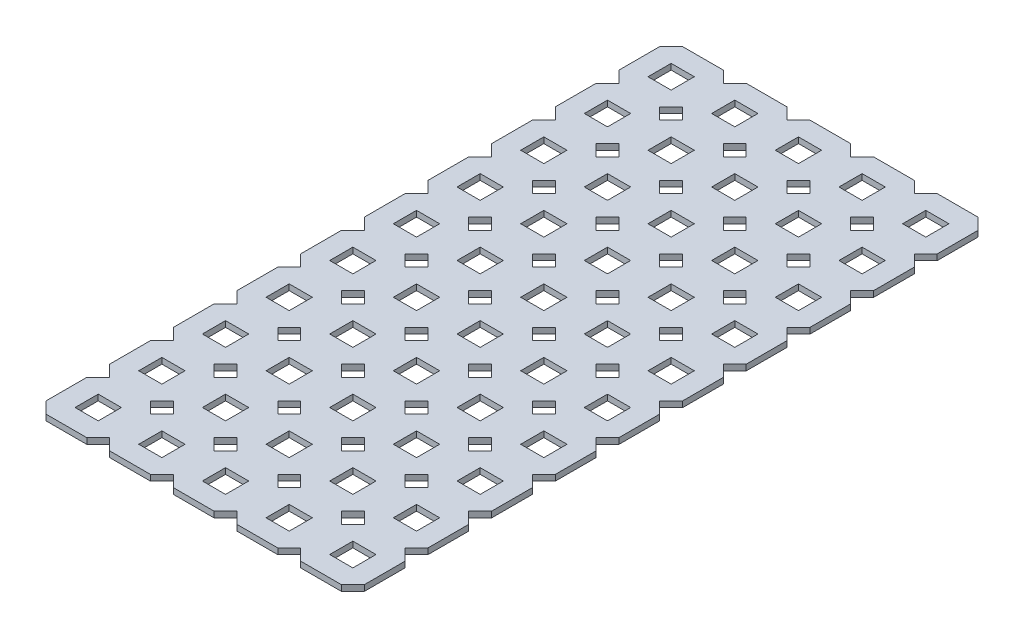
from build123d import *

# Parameters (mm, degrees)
SKETCH1_W           = 4.6228
SKETCH1_H           = 4.6228
BOSS_EXTRUDE1_DEPTH = 1.1684


with BuildPart() as part:
    # Sketch1 → Boss-Extrude1 (new body)
    with BuildSketch(Plane(origin=(0, 1.1684, 0), x_dir=(1, 0, 0), z_dir=(0, 1, 0))):
        Polygon((14.980985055, 127), (12.7, 124.719014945), (10.419014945, 127), (2.280985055, 127), (0, 124.719014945), (0, 116.580985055), (2.280985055, 114.3), (0, 112.019014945), (0, 103.880985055), (2.280985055, 101.6), (0, 99.319014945), (0, 91.180985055), (2.280985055, 88.9), (0, 86.619014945), (0, 78.480985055), (2.280985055, 76.2), (0, 73.919014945), (0, 65.780985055), (2.280985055, 63.5), (0, 61.219014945), (0, 53.080985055), (2.280985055, 50.8), (0, 48.519014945), (0, 40.380985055), (2.280985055, 38.1), (0, 35.819014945), (0, 27.680985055), (2.280985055, 25.4), (0, 23.119014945), (0, 14.980985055), (2.280985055, 12.7), (0, 10.419014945), (0, 2.280985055), (2.280985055, 0), (10.419014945, 0), (12.7, 2.280985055), (14.980985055, 0), (23.119014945, 0), (25.4, 2.280985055), (27.680985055, 0), (35.819014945, 0), (38.1, 2.280985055), (40.380985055, 0), (48.519014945, 0), (50.8, 2.280985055), (53.080985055, 0), (61.219014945, 0), (63.5, 2.280985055), (63.5, 10.419014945), (61.219014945, 12.7), (63.5, 14.980985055), (63.5, 23.119014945), (61.219014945, 25.4), (63.5, 27.680985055), (63.5, 35.819014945), (61.219014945, 38.1), (63.5, 40.380985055), (63.5, 48.519014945), (61.219014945, 50.8), (63.5, 53.080985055), (63.5, 61.219014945), (61.219014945, 63.5), (63.5, 65.780985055), (63.5, 73.919014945), (61.219014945, 76.2), (63.5, 78.480985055), (63.5, 86.619014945), (61.219014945, 88.9), (63.5, 91.180985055), (63.5, 99.319014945), (61.219014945, 101.6), (63.5, 103.880985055), (63.5, 112.019014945), (61.219014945, 114.3), (63.5, 116.580985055), (63.5, 124.719014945), (61.219014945, 127), (53.080985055, 127), (50.8, 124.719014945), (48.519014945, 127), (40.380985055, 127), (38.1, 124.719014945), (35.819014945, 127), (27.680985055, 127), (25.4, 124.719014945), (23.119014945, 127), align=None)
        Polygon((12.7, 112.019014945), (10.419014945, 114.3), (12.7, 116.580985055), (14.980985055, 114.3), align=None, mode=Mode.SUBTRACT)
        Polygon((12.7, 86.619014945), (10.419014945, 88.9), (12.7, 91.180985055), (14.980985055, 88.9), align=None, mode=Mode.SUBTRACT)
        Polygon((12.7, 61.219014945), (10.419014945, 63.5), (12.7, 65.780985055), (14.980985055, 63.5), align=None, mode=Mode.SUBTRACT)
        Polygon((12.7, 35.819014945), (10.419014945, 38.1), (12.7, 40.380985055), (14.980985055, 38.1), align=None, mode=Mode.SUBTRACT)
        Polygon((12.7, 10.419014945), (10.419014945, 12.7), (12.7, 14.980985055), (14.980985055, 12.7), align=None, mode=Mode.SUBTRACT)
        Polygon((25.4, 112.019014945), (23.119014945, 114.3), (25.4, 116.580985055), (27.680985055, 114.3), align=None, mode=Mode.SUBTRACT)
        Polygon((25.4, 86.619014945), (23.119014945, 88.9), (25.4, 91.180985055), (27.680985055, 88.9), align=None, mode=Mode.SUBTRACT)
        Polygon((25.4, 61.219014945), (23.119014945, 63.5), (25.4, 65.780985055), (27.680985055, 63.5), align=None, mode=Mode.SUBTRACT)
        Polygon((25.4, 35.819014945), (23.119014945, 38.1), (25.4, 40.380985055), (27.680985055, 38.1), align=None, mode=Mode.SUBTRACT)
        Polygon((25.4, 10.419014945), (23.119014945, 12.7), (25.4, 14.980985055), (27.680985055, 12.7), align=None, mode=Mode.SUBTRACT)
        Polygon((38.1, 112.019014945), (35.819014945, 114.3), (38.1, 116.580985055), (40.380985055, 114.3), align=None, mode=Mode.SUBTRACT)
        Polygon((38.1, 86.619014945), (35.819014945, 88.9), (38.1, 91.180985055), (40.380985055, 88.9), align=None, mode=Mode.SUBTRACT)
        Polygon((38.1, 61.219014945), (35.819014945, 63.5), (38.1, 65.780985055), (40.380985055, 63.5), align=None, mode=Mode.SUBTRACT)
        Polygon((38.1, 35.819014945), (35.819014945, 38.1), (38.1, 40.380985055), (40.380985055, 38.1), align=None, mode=Mode.SUBTRACT)
        Polygon((38.1, 10.419014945), (35.819014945, 12.7), (38.1, 14.980985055), (40.380985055, 12.7), align=None, mode=Mode.SUBTRACT)
        Polygon((50.8, 112.019014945), (48.519014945, 114.3), (50.8, 116.580985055), (53.080985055, 114.3), align=None, mode=Mode.SUBTRACT)
        Polygon((50.8, 86.619014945), (48.519014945, 88.9), (50.8, 91.180985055), (53.080985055, 88.9), align=None, mode=Mode.SUBTRACT)
        Polygon((50.8, 61.219014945), (48.519014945, 63.5), (50.8, 65.780985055), (53.080985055, 63.5), align=None, mode=Mode.SUBTRACT)
        Polygon((50.8, 35.819014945), (48.519014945, 38.1), (50.8, 40.380985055), (53.080985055, 38.1), align=None, mode=Mode.SUBTRACT)
        Polygon((50.8, 10.419014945), (48.519014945, 12.7), (50.8, 14.980985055), (53.080985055, 12.7), align=None, mode=Mode.SUBTRACT)
        with Locations((6.35, 120.65)):
            Rectangle(SKETCH1_W, SKETCH1_H, mode=Mode.SUBTRACT)
        with Locations((19.05, 120.65)):
            Rectangle(SKETCH1_W, SKETCH1_H, mode=Mode.SUBTRACT)
        with Locations((31.75, 120.65)):
            Rectangle(SKETCH1_W, SKETCH1_H, mode=Mode.SUBTRACT)
        with Locations((44.45, 120.65)):
            Rectangle(SKETCH1_W, SKETCH1_H, mode=Mode.SUBTRACT)
        with Locations((57.15, 120.65)):
            Rectangle(SKETCH1_W, SKETCH1_H, mode=Mode.SUBTRACT)
        with Locations((6.35, 107.95)):
            Rectangle(SKETCH1_W, SKETCH1_H, mode=Mode.SUBTRACT)
        with Locations((57.15, 107.95)):
            Rectangle(SKETCH1_W, SKETCH1_H, mode=Mode.SUBTRACT)
        with Locations((6.35, 95.25)):
            Rectangle(SKETCH1_W, SKETCH1_H, mode=Mode.SUBTRACT)
        with Locations((57.15, 95.25)):
            Rectangle(SKETCH1_W, SKETCH1_H, mode=Mode.SUBTRACT)
        with Locations((6.35, 82.55)):
            Rectangle(SKETCH1_W, SKETCH1_H, mode=Mode.SUBTRACT)
        with Locations((57.15, 82.55)):
            Rectangle(SKETCH1_W, SKETCH1_H, mode=Mode.SUBTRACT)
        with Locations((6.35, 69.85)):
            Rectangle(SKETCH1_W, SKETCH1_H, mode=Mode.SUBTRACT)
        with Locations((57.15, 69.85)):
            Rectangle(SKETCH1_W, SKETCH1_H, mode=Mode.SUBTRACT)
        with Locations((6.35, 57.15)):
            Rectangle(SKETCH1_W, SKETCH1_H, mode=Mode.SUBTRACT)
        with Locations((57.15, 57.15)):
            Rectangle(SKETCH1_W, SKETCH1_H, mode=Mode.SUBTRACT)
        with Locations((6.35, 44.45)):
            Rectangle(SKETCH1_W, SKETCH1_H, mode=Mode.SUBTRACT)
        with Locations((57.15, 44.45)):
            Rectangle(SKETCH1_W, SKETCH1_H, mode=Mode.SUBTRACT)
        with Locations((6.35, 31.75)):
            Rectangle(SKETCH1_W, SKETCH1_H, mode=Mode.SUBTRACT)
        with Locations((57.15, 31.75)):
            Rectangle(SKETCH1_W, SKETCH1_H, mode=Mode.SUBTRACT)
        with Locations((6.35, 19.05)):
            Rectangle(SKETCH1_W, SKETCH1_H, mode=Mode.SUBTRACT)
        with Locations((57.15, 19.05)):
            Rectangle(SKETCH1_W, SKETCH1_H, mode=Mode.SUBTRACT)
        with Locations((6.35, 6.35)):
            Rectangle(SKETCH1_W, SKETCH1_H, mode=Mode.SUBTRACT)
        with Locations((19.05, 6.35)):
            Rectangle(SKETCH1_W, SKETCH1_H, mode=Mode.SUBTRACT)
        with Locations((31.75, 6.35)):
            Rectangle(SKETCH1_W, SKETCH1_H, mode=Mode.SUBTRACT)
        with Locations((19.05, 107.95)):
            Rectangle(SKETCH1_W, SKETCH1_H, mode=Mode.SUBTRACT)
        with Locations((31.75, 107.95)):
            Rectangle(SKETCH1_W, SKETCH1_H, mode=Mode.SUBTRACT)
        with Locations((44.45, 107.95)):
            Rectangle(SKETCH1_W, SKETCH1_H, mode=Mode.SUBTRACT)
        with Locations((19.05, 95.25)):
            Rectangle(SKETCH1_W, SKETCH1_H, mode=Mode.SUBTRACT)
        with Locations((31.75, 95.25)):
            Rectangle(SKETCH1_W, SKETCH1_H, mode=Mode.SUBTRACT)
        with Locations((44.45, 95.25)):
            Rectangle(SKETCH1_W, SKETCH1_H, mode=Mode.SUBTRACT)
        with Locations((19.05, 82.55)):
            Rectangle(SKETCH1_W, SKETCH1_H, mode=Mode.SUBTRACT)
        with Locations((31.75, 82.55)):
            Rectangle(SKETCH1_W, SKETCH1_H, mode=Mode.SUBTRACT)
        with Locations((44.45, 82.55)):
            Rectangle(SKETCH1_W, SKETCH1_H, mode=Mode.SUBTRACT)
        with Locations((19.05, 69.85)):
            Rectangle(SKETCH1_W, SKETCH1_H, mode=Mode.SUBTRACT)
        with Locations((31.75, 69.85)):
            Rectangle(SKETCH1_W, SKETCH1_H, mode=Mode.SUBTRACT)
        with Locations((44.45, 69.85)):
            Rectangle(SKETCH1_W, SKETCH1_H, mode=Mode.SUBTRACT)
        with Locations((19.05, 57.15)):
            Rectangle(SKETCH1_W, SKETCH1_H, mode=Mode.SUBTRACT)
        with Locations((31.75, 57.15)):
            Rectangle(SKETCH1_W, SKETCH1_H, mode=Mode.SUBTRACT)
        with Locations((44.45, 57.15)):
            Rectangle(SKETCH1_W, SKETCH1_H, mode=Mode.SUBTRACT)
        with Locations((19.05, 44.45)):
            Rectangle(SKETCH1_W, SKETCH1_H, mode=Mode.SUBTRACT)
        with Locations((31.75, 44.45)):
            Rectangle(SKETCH1_W, SKETCH1_H, mode=Mode.SUBTRACT)
        with Locations((44.45, 44.45)):
            Rectangle(SKETCH1_W, SKETCH1_H, mode=Mode.SUBTRACT)
        with Locations((19.05, 31.75)):
            Rectangle(SKETCH1_W, SKETCH1_H, mode=Mode.SUBTRACT)
        with Locations((31.75, 31.75)):
            Rectangle(SKETCH1_W, SKETCH1_H, mode=Mode.SUBTRACT)
        with Locations((44.45, 31.75)):
            Rectangle(SKETCH1_W, SKETCH1_H, mode=Mode.SUBTRACT)
        with Locations((19.05, 19.05)):
            Rectangle(SKETCH1_W, SKETCH1_H, mode=Mode.SUBTRACT)
        with Locations((31.75, 19.05)):
            Rectangle(SKETCH1_W, SKETCH1_H, mode=Mode.SUBTRACT)
        with Locations((57.15, 6.35)):
            Rectangle(SKETCH1_W, SKETCH1_H, mode=Mode.SUBTRACT)
        with Locations((44.45, 19.05)):
            Rectangle(SKETCH1_W, SKETCH1_H, mode=Mode.SUBTRACT)
        with Locations((44.45, 6.35)):
            Rectangle(SKETCH1_W, SKETCH1_H, mode=Mode.SUBTRACT)
        Polygon((50.8, 23.119014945), (48.519014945, 25.4), (50.8, 27.680985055), (53.080985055, 25.4), align=None, mode=Mode.SUBTRACT)
        Polygon((50.8, 48.519014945), (48.519014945, 50.8), (50.8, 53.080985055), (53.080985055, 50.8), align=None, mode=Mode.SUBTRACT)
        Polygon((50.8, 73.919014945), (48.519014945, 76.2), (50.8, 78.480985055), (53.080985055, 76.2), align=None, mode=Mode.SUBTRACT)
        Polygon((50.8, 99.319014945), (48.519014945, 101.6), (50.8, 103.880985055), (53.080985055, 101.6), align=None, mode=Mode.SUBTRACT)
        Polygon((38.1, 23.119014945), (35.819014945, 25.4), (38.1, 27.680985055), (40.380985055, 25.4), align=None, mode=Mode.SUBTRACT)
        Polygon((38.1, 48.519014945), (35.819014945, 50.8), (38.1, 53.080985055), (40.380985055, 50.8), align=None, mode=Mode.SUBTRACT)
        Polygon((38.1, 73.919014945), (35.819014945, 76.2), (38.1, 78.480985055), (40.380985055, 76.2), align=None, mode=Mode.SUBTRACT)
        Polygon((38.1, 99.319014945), (35.819014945, 101.6), (38.1, 103.880985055), (40.380985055, 101.6), align=None, mode=Mode.SUBTRACT)
        Polygon((25.4, 23.119014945), (23.119014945, 25.4), (25.4, 27.680985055), (27.680985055, 25.4), align=None, mode=Mode.SUBTRACT)
        Polygon((25.4, 48.519014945), (23.119014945, 50.8), (25.4, 53.080985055), (27.680985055, 50.8), align=None, mode=Mode.SUBTRACT)
        Polygon((25.4, 73.919014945), (23.119014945, 76.2), (25.4, 78.480985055), (27.680985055, 76.2), align=None, mode=Mode.SUBTRACT)
        Polygon((25.4, 99.319014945), (23.119014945, 101.6), (25.4, 103.880985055), (27.680985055, 101.6), align=None, mode=Mode.SUBTRACT)
        Polygon((12.7, 23.119014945), (10.419014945, 25.4), (12.7, 27.680985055), (14.980985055, 25.4), align=None, mode=Mode.SUBTRACT)
        Polygon((12.7, 48.519014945), (10.419014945, 50.8), (12.7, 53.080985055), (14.980985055, 50.8), align=None, mode=Mode.SUBTRACT)
        Polygon((12.7, 73.919014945), (10.419014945, 76.2), (12.7, 78.480985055), (14.980985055, 76.2), align=None, mode=Mode.SUBTRACT)
        Polygon((12.7, 99.319014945), (10.419014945, 101.6), (12.7, 103.880985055), (14.980985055, 101.6), align=None, mode=Mode.SUBTRACT)
    extrude(amount=-BOSS_EXTRUDE1_DEPTH)


solid = part.part
